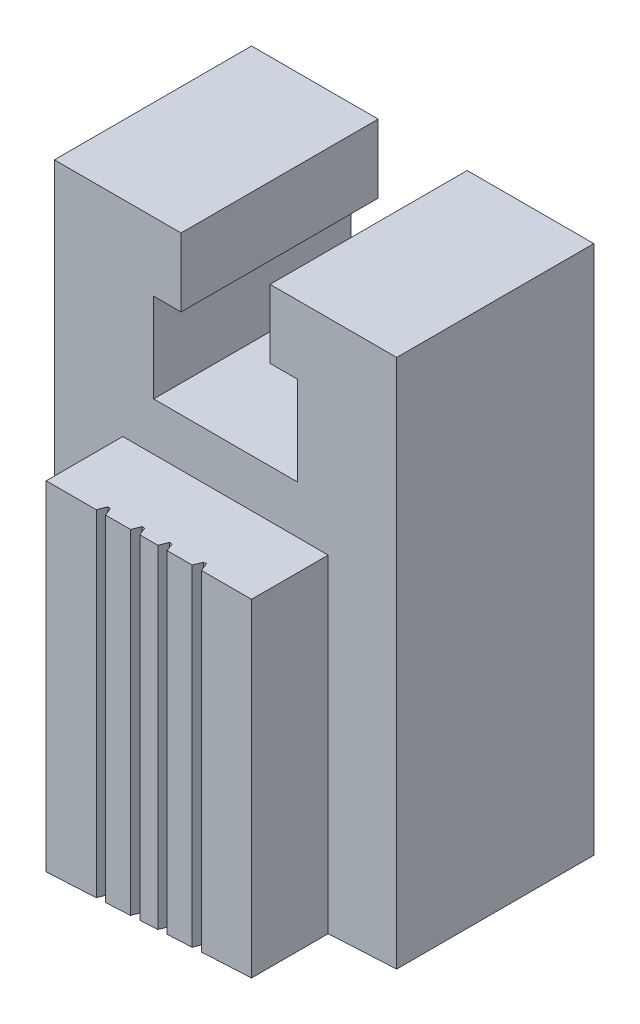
from build123d import *

# Parameters (mm, degrees)
EXTRUDE_1_DEPTH     = 20
SKETCH_2_OUTSIDE_W  = 32.246
SKETCH_2_OUTSIDE_H  = 52.246
CUT_EXTRUDE_1_DEPTH = 52.23475383
SKETCH_3_OUTSIDE_W  = 37.246
SKETCH_3_OUTSIDE_H  = 32.246
CUT_EXTRUDE_2_DEPTH = 52.23475383


with BuildPart() as part:
    # Sketch 1 → Extrude 1 (new body)
    with BuildSketch(Plane.XY):
        Polygon((0, 0), (25, 1.310194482), (25, 40), (15.75, 40), (15.75, 35), (17.75, 35), (17.75, 28.5), (7.25, 28.5), (7.25, 35), (9.25, 35), (9.25, 40), (0, 40), align=None)
    extrude(amount=EXTRUDE_1_DEPTH)

    # Sketch 2 outside → Cut-Extrude 1 (cut, through all)
    with BuildSketch(Plane(origin=(25, 0, 0), x_dir=(0, 0, -1), z_dir=(1, 0, 0))):
        with Locations((-10, 20)):
            Rectangle(SKETCH_2_OUTSIDE_W, SKETCH_2_OUTSIDE_H)
        Polygon((-20, 0), (0, 0), (0, 40), (-14.4, 40), (-14.4, 25), (-20, 25), align=None, mode=Mode.SUBTRACT)
    extrude(amount=-CUT_EXTRUDE_1_DEPTH, mode=Mode.SUBTRACT)

    # Sketch 3 outside → Cut-Extrude 2 (cut, through all)
    with BuildSketch(Plane(origin=(0, 40, 0), x_dir=(1, 0, 0), z_dir=(0, 1, 0))):
        with Locations((12.5, -10)):
            Rectangle(SKETCH_3_OUTSIDE_W, SKETCH_3_OUTSIDE_H)
        Polygon((0, -14.4), (0, 0), (25, 0), (25, -14.4), (20, -14.4), (20, -20), (16.340000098, -20), (16.099999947, -19.4), (15.900000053, -19.4), (15.659999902, -20), (13.840000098, -20), (13.599999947, -19.4), (13.400000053, -19.4), (13.159999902, -20), (11.840000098, -20), (11.599999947, -19.4), (11.400000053, -19.4), (11.159999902, -20), (9.340000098, -20), (9.099999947, -19.4), (8.900000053, -19.4), (8.659999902, -20), (5, -20), (5, -14.4), align=None, mode=Mode.SUBTRACT)
    extrude(amount=-CUT_EXTRUDE_2_DEPTH, mode=Mode.SUBTRACT)


solid = part.part
